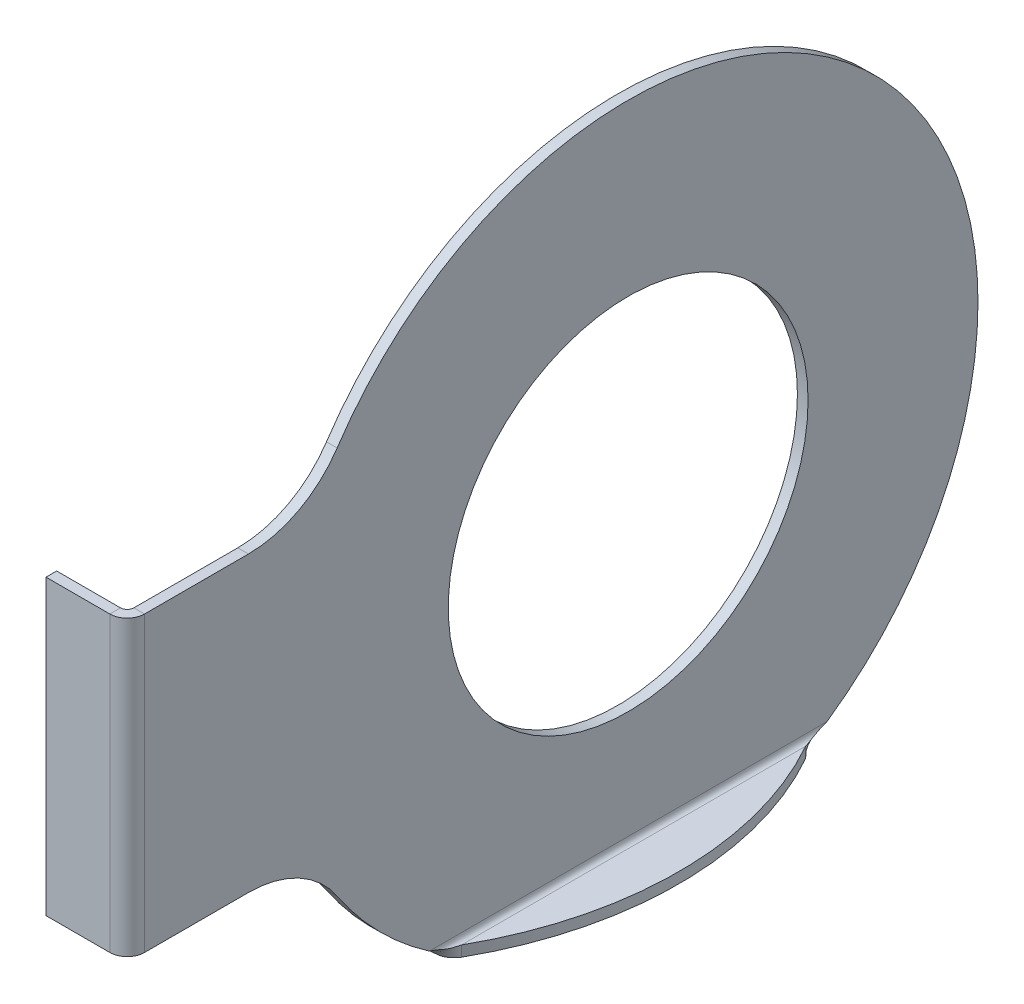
ISO-10303-21;
HEADER;
FILE_DESCRIPTION(('STEP AP214'),'2;1');
FILE_NAME('part.step','',(''),(''),'','','');
FILE_SCHEMA(('AUTOMOTIVE_DESIGN { 1 0 10303 214 1 1 1 1 }'));
ENDSEC;
DATA;
#1=APPLICATION_CONTEXT('core data for automotive mechanical design processes');
#2=APPLICATION_PROTOCOL_DEFINITION('international standard','automotive_design',2000,#1);
#3=PRODUCT_CONTEXT('',#1,'mechanical');
#4=PRODUCT('Part','Part','',(#3));
#5=PRODUCT_RELATED_PRODUCT_CATEGORY('part','',(#4));
#6=PRODUCT_DEFINITION_FORMATION('','',#4);
#7=PRODUCT_DEFINITION_CONTEXT('part definition',#1,'design');
#8=PRODUCT_DEFINITION('design','',#6,#7);
#9=PRODUCT_DEFINITION_SHAPE('','',#8);
#10=(LENGTH_UNIT() NAMED_UNIT(*) SI_UNIT(.MILLI.,.METRE.));
#11=(NAMED_UNIT(*) PLANE_ANGLE_UNIT() SI_UNIT($,.RADIAN.));
#12=(NAMED_UNIT(*) SI_UNIT($,.STERADIAN.) SOLID_ANGLE_UNIT());
#13=UNCERTAINTY_MEASURE_WITH_UNIT(LENGTH_MEASURE(1.E-05),#10,'distance_accuracy_value','');
#14=(GEOMETRIC_REPRESENTATION_CONTEXT(3) GLOBAL_UNCERTAINTY_ASSIGNED_CONTEXT((#13)) GLOBAL_UNIT_ASSIGNED_CONTEXT((#10,
#11,#12)) REPRESENTATION_CONTEXT('',''));
#15=CARTESIAN_POINT('',(0.,0.,0.));
#16=DIRECTION('',(0.,0.,1.));
#17=DIRECTION('',(1.,0.,0.));
#18=AXIS2_PLACEMENT_3D('',#15,#16,#17);
#19=CARTESIAN_POINT('',(0.,38.,56.9934206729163));
#20=DIRECTION('',(-1.,0.,0.));
#21=DIRECTION('',(0.,0.,1.));
#22=AXIS2_PLACEMENT_3D('',#19,#20,#21);
#23=PLANE('',#22);
#24=CARTESIAN_POINT('',(0.,0.,0.));
#25=DIRECTION('',(1.,0.,0.));
#26=DIRECTION('',(0.,0.,-1.));
#27=AXIS2_PLACEMENT_3D('',#24,#25,#26);
#28=CIRCLE('',#27,27.);
#29=CARTESIAN_POINT('',(0.,0.,-27.));
#30=VERTEX_POINT('',#29);
#31=EDGE_CURVE('E324',#30,#30,#28,.T.);
#32=ORIENTED_EDGE('',*,*,#31,.T.);
#33=EDGE_LOOP('',(#32));
#34=FACE_BOUND('',#33,.T.);
#35=DIRECTION('',(0.,0.,-1.));
#36=VECTOR('',#35,1.);
#37=CARTESIAN_POINT('',(0.,-22.,56.9934206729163));
#38=LINE('',#37,#36);
#39=CARTESIAN_POINT('',(0.,-22.,72.590498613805));
#40=VERTEX_POINT('',#39);
#41=CARTESIAN_POINT('',(0.,-22.,56.9934206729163));
#42=VERTEX_POINT('',#41);
#43=EDGE_CURVE('E74',#40,#42,#38,.T.);
#44=ORIENTED_EDGE('',*,*,#43,.F.);
#45=DIRECTION('',(0.,1.,0.));
#46=VECTOR('',#45,1.);
#47=CARTESIAN_POINT('',(0.,38.,72.590498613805));
#48=LINE('',#47,#46);
#49=CARTESIAN_POINT('',(0.,22.,72.590498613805));
#50=VERTEX_POINT('',#49);
#51=EDGE_CURVE('E66',#40,#50,#48,.T.);
#52=ORIENTED_EDGE('',*,*,#51,.T.);
#53=DIRECTION('',(0.,0.,1.));
#54=VECTOR('',#53,1.);
#55=CARTESIAN_POINT('',(0.,22.,56.9934206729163));
#56=LINE('',#55,#54);
#57=CARTESIAN_POINT('',(0.,22.,56.9934206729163));
#58=VERTEX_POINT('',#57);
#59=EDGE_CURVE('E82',#58,#50,#56,.T.);
#60=ORIENTED_EDGE('',*,*,#59,.F.);
#61=CARTESIAN_POINT('',(0.,38.,56.9934206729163));
#62=DIRECTION('',(-1.,0.,0.));
#63=DIRECTION('',(0.,0.,1.));
#64=AXIS2_PLACEMENT_3D('',#61,#62,#63);
#65=CIRCLE('',#64,16.);
#66=CARTESIAN_POINT('',(0.,29.1240875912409,43.6810888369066));
#67=VERTEX_POINT('',#66);
#68=EDGE_CURVE('E323',#67,#58,#65,.T.);
#69=ORIENTED_EDGE('',*,*,#68,.F.);
#70=CARTESIAN_POINT('',(0.,0.,0.));
#71=DIRECTION('',(1.,0.,0.));
#72=DIRECTION('',(0.,0.,-1.));
#73=AXIS2_PLACEMENT_3D('',#70,#71,#72);
#74=CIRCLE('',#73,52.5);
#75=CARTESIAN_POINT('',(0.,-43.1949484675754,-29.8403489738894));
#76=VERTEX_POINT('',#75);
#77=EDGE_CURVE('E339',#76,#67,#74,.T.);
#78=ORIENTED_EDGE('',*,*,#77,.F.);
#79=DIRECTION('',(0.,0.,1.));
#80=VECTOR('',#79,1.);
#81=CARTESIAN_POINT('',(0.,-43.1949484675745,56.9934206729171));
#82=LINE('',#81,#80);
#83=CARTESIAN_POINT('',(0.,-43.1949484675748,29.8403489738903));
#84=VERTEX_POINT('',#83);
#85=EDGE_CURVE('E394',#76,#84,#82,.T.);
#86=ORIENTED_EDGE('',*,*,#85,.T.);
#87=CARTESIAN_POINT('',(0.,-29.1240875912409,43.6810888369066));
#88=VERTEX_POINT('',#87);
#89=EDGE_CURVE('E331',#88,#84,#74,.T.);
#90=ORIENTED_EDGE('',*,*,#89,.F.);
#91=CARTESIAN_POINT('',(0.,-38.,56.9934206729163));
#92=DIRECTION('',(-1.,0.,0.));
#93=DIRECTION('',(0.,0.,-1.));
#94=AXIS2_PLACEMENT_3D('',#91,#92,#93);
#95=CIRCLE('',#94,16.);
#96=EDGE_CURVE('E337',#42,#88,#95,.T.);
#97=ORIENTED_EDGE('',*,*,#96,.F.);
#98=EDGE_LOOP('',(#44,#52,#60,#69,#78,#86,#90,#97));
#99=FACE_BOUND('',#98,.T.);
#100=ADVANCED_FACE('F57',(#34,#99),#23,.T.);
#101=CARTESIAN_POINT('',(1.6,0.,0.));
#102=DIRECTION('',(-1.,0.,0.));
#103=DIRECTION('',(0.,0.,1.));
#104=AXIS2_PLACEMENT_3D('',#101,#102,#103);
#105=CYLINDRICAL_SURFACE('',#104,52.5);
#106=CARTESIAN_POINT('',(1.6,-43.1949484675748,29.8403489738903));
#107=CARTESIAN_POINT('',(0.,-43.1949484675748,29.8403489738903));
#108=B_SPLINE_CURVE_WITH_KNOTS('',1,(#106,#107),.UNSPECIFIED.,.F.,.F.,(2,2),(0.,1.),.UNSPECIFIED.);
#109=CARTESIAN_POINT('',(1.6,-43.1949484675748,29.8403489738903));
#110=VERTEX_POINT('',#109);
#111=EDGE_CURVE('E311',#110,#84,#108,.T.);
#112=ORIENTED_EDGE('',*,*,#111,.F.);
#113=CARTESIAN_POINT('',(1.6,0.,0.));
#114=DIRECTION('',(1.,0.,0.));
#115=DIRECTION('',(0.,0.,-1.));
#116=AXIS2_PLACEMENT_3D('',#113,#114,#115);
#117=CIRCLE('',#116,52.5);
#118=CARTESIAN_POINT('',(1.6,-29.1240875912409,43.6810888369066));
#119=VERTEX_POINT('',#118);
#120=EDGE_CURVE('E344',#119,#110,#117,.T.);
#121=ORIENTED_EDGE('',*,*,#120,.F.);
#122=DIRECTION('',(-1.,0.,0.));
#123=VECTOR('',#122,1.);
#124=CARTESIAN_POINT('',(1.6,-29.1240875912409,43.6810888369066));
#125=LINE('',#124,#123);
#126=EDGE_CURVE('E343',#119,#88,#125,.T.);
#127=ORIENTED_EDGE('',*,*,#126,.T.);
#128=ORIENTED_EDGE('',*,*,#89,.T.);
#129=EDGE_LOOP('',(#112,#121,#127,#128));
#130=FACE_BOUND('',#129,.T.);
#131=ADVANCED_FACE('F382',(#130),#105,.T.);
#132=CARTESIAN_POINT('',(1.6,38.,56.9934206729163));
#133=DIRECTION('',(-1.,0.,0.));
#134=DIRECTION('',(0.,0.,1.));
#135=AXIS2_PLACEMENT_3D('',#132,#133,#134);
#136=PLANE('',#135);
#137=DIRECTION('',(0.,1.,0.));
#138=VECTOR('',#137,1.);
#139=CARTESIAN_POINT('',(1.6,38.,72.590498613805));
#140=LINE('',#139,#138);
#141=CARTESIAN_POINT('',(1.6,-22.,72.590498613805));
#142=VERTEX_POINT('',#141);
#143=CARTESIAN_POINT('',(1.6,22.,72.590498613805));
#144=VERTEX_POINT('',#143);
#145=EDGE_CURVE('E405',#142,#144,#140,.T.);
#146=ORIENTED_EDGE('',*,*,#145,.F.);
#147=DIRECTION('',(0.,0.,-1.));
#148=VECTOR('',#147,1.);
#149=CARTESIAN_POINT('',(1.6,-22.,56.9934206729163));
#150=LINE('',#149,#148);
#151=CARTESIAN_POINT('',(1.6,-22.,56.9934206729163));
#152=VERTEX_POINT('',#151);
#153=EDGE_CURVE('E61',#142,#152,#150,.T.);
#154=ORIENTED_EDGE('',*,*,#153,.T.);
#155=CARTESIAN_POINT('',(1.6,-38.,56.9934206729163));
#156=DIRECTION('',(-1.,0.,0.));
#157=DIRECTION('',(0.,0.,-1.));
#158=AXIS2_PLACEMENT_3D('',#155,#156,#157);
#159=CIRCLE('',#158,16.);
#160=EDGE_CURVE('E332',#152,#119,#159,.T.);
#161=ORIENTED_EDGE('',*,*,#160,.T.);
#162=ORIENTED_EDGE('',*,*,#120,.T.);
#163=DIRECTION('',(0.,0.,1.));
#164=VECTOR('',#163,1.);
#165=CARTESIAN_POINT('',(1.6,-43.1949484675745,56.9934206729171));
#166=LINE('',#165,#164);
#167=CARTESIAN_POINT('',(1.6,-43.1949484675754,-29.8403489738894));
#168=VERTEX_POINT('',#167);
#169=EDGE_CURVE('E352',#168,#110,#166,.T.);
#170=ORIENTED_EDGE('',*,*,#169,.F.);
#171=CARTESIAN_POINT('',(1.6,29.1240875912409,43.6810888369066));
#172=VERTEX_POINT('',#171);
#173=EDGE_CURVE('E334',#168,#172,#117,.T.);
#174=ORIENTED_EDGE('',*,*,#173,.T.);
#175=CARTESIAN_POINT('',(1.6,38.,56.9934206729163));
#176=DIRECTION('',(-1.,0.,0.));
#177=DIRECTION('',(0.,0.,1.));
#178=AXIS2_PLACEMENT_3D('',#175,#176,#177);
#179=CIRCLE('',#178,16.);
#180=CARTESIAN_POINT('',(1.6,22.,56.9934206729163));
#181=VERTEX_POINT('',#180);
#182=EDGE_CURVE('E327',#172,#181,#179,.T.);
#183=ORIENTED_EDGE('',*,*,#182,.T.);
#184=DIRECTION('',(0.,0.,1.));
#185=VECTOR('',#184,1.);
#186=CARTESIAN_POINT('',(1.6,22.,56.9934206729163));
#187=LINE('',#186,#185);
#188=EDGE_CURVE('E330',#181,#144,#187,.T.);
#189=ORIENTED_EDGE('',*,*,#188,.T.);
#190=EDGE_LOOP('',(#146,#154,#161,#162,#170,#174,#183,#189));
#191=FACE_BOUND('',#190,.T.);
#192=CARTESIAN_POINT('',(1.6,0.,0.));
#193=DIRECTION('',(1.,0.,0.));
#194=DIRECTION('',(0.,0.,-1.));
#195=AXIS2_PLACEMENT_3D('',#192,#193,#194);
#196=CIRCLE('',#195,27.);
#197=CARTESIAN_POINT('',(1.6,0.,-27.));
#198=VERTEX_POINT('',#197);
#199=EDGE_CURVE('E315',#198,#198,#196,.T.);
#200=ORIENTED_EDGE('',*,*,#199,.F.);
#201=EDGE_LOOP('',(#200));
#202=FACE_BOUND('',#201,.T.);
#203=ADVANCED_FACE('F384',(#191,#202),#136,.F.);
#204=CARTESIAN_POINT('',(1.6,38.,56.9934206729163));
#205=DIRECTION('',(-1.,0.,0.));
#206=DIRECTION('',(0.,0.,1.));
#207=AXIS2_PLACEMENT_3D('',#204,#205,#206);
#208=CYLINDRICAL_SURFACE('',#207,16.);
#209=ORIENTED_EDGE('',*,*,#68,.T.);
#210=DIRECTION('',(-1.,0.,0.));
#211=VECTOR('',#210,1.);
#212=CARTESIAN_POINT('',(1.6,22.,56.9934206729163));
#213=LINE('',#212,#211);
#214=EDGE_CURVE('E350',#181,#58,#213,.T.);
#215=ORIENTED_EDGE('',*,*,#214,.F.);
#216=ORIENTED_EDGE('',*,*,#182,.F.);
#217=DIRECTION('',(-1.,0.,0.));
#218=VECTOR('',#217,1.);
#219=CARTESIAN_POINT('',(1.6,29.1240875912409,43.6810888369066));
#220=LINE('',#219,#218);
#221=EDGE_CURVE('E340',#172,#67,#220,.T.);
#222=ORIENTED_EDGE('',*,*,#221,.T.);
#223=EDGE_LOOP('',(#209,#215,#216,#222));
#224=FACE_BOUND('',#223,.T.);
#225=ADVANCED_FACE('F383',(#224),#208,.F.);
#226=CARTESIAN_POINT('',(1.6,22.,56.9934206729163));
#227=DIRECTION('',(0.,-1.,0.));
#228=DIRECTION('',(0.,0.,-1.));
#229=AXIS2_PLACEMENT_3D('',#226,#227,#228);
#230=PLANE('',#229);
#231=DIRECTION('',(-1.,0.,0.));
#232=VECTOR('',#231,1.);
#233=CARTESIAN_POINT('',(1.6,22.,72.590498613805));
#234=LINE('',#233,#232);
#235=EDGE_CURVE('E425',#144,#50,#234,.T.);
#236=ORIENTED_EDGE('',*,*,#235,.F.);
#237=ORIENTED_EDGE('',*,*,#188,.F.);
#238=ORIENTED_EDGE('',*,*,#214,.T.);
#239=ORIENTED_EDGE('',*,*,#59,.T.);
#240=EDGE_LOOP('',(#236,#237,#238,#239));
#241=FACE_BOUND('',#240,.T.);
#242=ADVANCED_FACE('F536',(#241),#230,.F.);
#243=CARTESIAN_POINT('',(1.6,-22.,56.9934206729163));
#244=DIRECTION('',(0.,1.,0.));
#245=DIRECTION('',(0.,0.,1.));
#246=AXIS2_PLACEMENT_3D('',#243,#244,#245);
#247=PLANE('',#246);
#248=DIRECTION('',(1.,0.,0.));
#249=VECTOR('',#248,1.);
#250=CARTESIAN_POINT('',(1.6,-22.,72.590498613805));
#251=LINE('',#250,#249);
#252=EDGE_CURVE('E12',#40,#142,#251,.T.);
#253=ORIENTED_EDGE('',*,*,#252,.F.);
#254=ORIENTED_EDGE('',*,*,#43,.T.);
#255=DIRECTION('',(-1.,0.,0.));
#256=VECTOR('',#255,1.);
#257=CARTESIAN_POINT('',(1.6,-22.,56.9934206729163));
#258=LINE('',#257,#256);
#259=EDGE_CURVE('E347',#152,#42,#258,.T.);
#260=ORIENTED_EDGE('',*,*,#259,.F.);
#261=ORIENTED_EDGE('',*,*,#153,.F.);
#262=EDGE_LOOP('',(#253,#254,#260,#261));
#263=FACE_BOUND('',#262,.T.);
#264=ADVANCED_FACE('F59',(#263),#247,.F.);
#265=CARTESIAN_POINT('',(1.6,-38.,56.9934206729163));
#266=DIRECTION('',(-1.,0.,0.));
#267=DIRECTION('',(0.,0.,1.));
#268=AXIS2_PLACEMENT_3D('',#265,#266,#267);
#269=CYLINDRICAL_SURFACE('',#268,16.);
#270=ORIENTED_EDGE('',*,*,#96,.T.);
#271=ORIENTED_EDGE('',*,*,#126,.F.);
#272=ORIENTED_EDGE('',*,*,#160,.F.);
#273=ORIENTED_EDGE('',*,*,#259,.T.);
#274=EDGE_LOOP('',(#270,#271,#272,#273));
#275=FACE_BOUND('',#274,.T.);
#276=ADVANCED_FACE('F380',(#275),#269,.F.);
#277=CARTESIAN_POINT('',(0.,-43.1949484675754,-29.8403489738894));
#278=CARTESIAN_POINT('',(1.6,-43.1949484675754,-29.8403489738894));
#279=B_SPLINE_CURVE_WITH_KNOTS('',1,(#277,#278),.UNSPECIFIED.,.F.,.F.,(2,2),(0.,1.),.UNSPECIFIED.);
#280=EDGE_CURVE('E401',#76,#168,#279,.T.);
#281=ORIENTED_EDGE('',*,*,#280,.F.);
#282=ORIENTED_EDGE('',*,*,#77,.T.);
#283=ORIENTED_EDGE('',*,*,#221,.F.);
#284=ORIENTED_EDGE('',*,*,#173,.F.);
#285=EDGE_LOOP('',(#281,#282,#283,#284));
#286=FACE_BOUND('',#285,.T.);
#287=ADVANCED_FACE('F370',(#286),#105,.T.);
#288=CARTESIAN_POINT('',(1.6,0.,0.));
#289=DIRECTION('',(-1.,0.,0.));
#290=DIRECTION('',(0.,0.,1.));
#291=AXIS2_PLACEMENT_3D('',#288,#289,#290);
#292=CYLINDRICAL_SURFACE('',#291,27.);
#293=ORIENTED_EDGE('',*,*,#199,.T.);
#294=EDGE_LOOP('',(#293));
#295=FACE_BOUND('',#294,.T.);
#296=ORIENTED_EDGE('',*,*,#31,.F.);
#297=EDGE_LOOP('',(#296));
#298=FACE_BOUND('',#297,.T.);
#299=ADVANCED_FACE('F285',(#295,#298),#292,.F.);
#300=CARTESIAN_POINT('',(2.39999999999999,-45.5949484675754,-25.8265055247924));
#301=CARTESIAN_POINT('',(2.08581418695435,-45.5949484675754,-26.1610207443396));
#302=CARTESIAN_POINT('',(1.77180507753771,-45.5324828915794,-26.4954794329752));
#303=CARTESIAN_POINT('',(1.19131444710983,-45.2920357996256,-27.164453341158));
#304=CARTESIAN_POINT('',(0.925087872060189,-45.114148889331,-27.4989402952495));
#305=CARTESIAN_POINT('',(0.480799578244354,-44.6698605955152,-28.1679142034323));
#306=CARTESIAN_POINT('',(0.302912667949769,-44.4036340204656,-28.5024011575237));
#307=CARTESIAN_POINT('',(0.0624655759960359,-43.8231433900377,-29.1713750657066));
#308=CARTESIAN_POINT('',(0.,-43.5091342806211,-29.5058337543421));
#309=CARTESIAN_POINT('',(0.,-43.1949484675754,-29.8403489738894));
#310=CARTESIAN_POINT('',(2.4,-43.9949484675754,-25.8265055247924));
#311=CARTESIAN_POINT('',(2.2952785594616,-43.9949484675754,-26.1609978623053));
#312=CARTESIAN_POINT('',(2.19060169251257,-43.9741266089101,-26.4954794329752));
#313=CARTESIAN_POINT('',(1.99710481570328,-43.8939775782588,-27.1644533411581));
#314=CARTESIAN_POINT('',(1.90836262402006,-43.834681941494,-27.4989402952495));
#315=CARTESIAN_POINT('',(1.76026652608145,-43.6865858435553,-28.1679142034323));
#316=CARTESIAN_POINT('',(1.70097088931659,-43.5978436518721,-28.5024011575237));
#317=CARTESIAN_POINT('',(1.62082185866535,-43.4043467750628,-29.1713750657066));
#318=CARTESIAN_POINT('',(1.6,-43.2996699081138,-29.5058566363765));
#319=CARTESIAN_POINT('',(1.6,-43.1949484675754,-29.8403489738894));
#320=B_SPLINE_SURFACE_WITH_KNOTS('',1,3,((#300,#301,#302,#303,#304,#305,#306,#307,#308,#309),
(#310,#311,#312,#313,#314,#315,#316,#317,#318,#319)),.UNSPECIFIED.,.F.,.F.,.F.,(2,2),(4,2,2,2,
4),(0.,1.),(0.,0.25,0.5,0.75,1.),.UNSPECIFIED.);
#321=CARTESIAN_POINT('',(2.4,-43.9949484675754,-25.8265055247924));
#322=CARTESIAN_POINT('',(2.39999999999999,-45.5949484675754,-25.8265055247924));
#323=B_SPLINE_CURVE_WITH_KNOTS('',1,(#321,#322),.UNSPECIFIED.,.F.,.F.,(2,2),(0.,1.),.UNSPECIFIED.);
#324=CARTESIAN_POINT('',(2.40000000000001,-45.5949484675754,-25.8265055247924));
#325=VERTEX_POINT('',#324);
#326=CARTESIAN_POINT('',(2.4,-43.9949484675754,-25.8265055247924));
#327=VERTEX_POINT('',#326);
#328=EDGE_CURVE('E492',#325,#327,#323,.F.);
#329=CARTESIAN_POINT('',(2.39999999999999,-45.5949484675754,-25.8265055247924));
#330=CARTESIAN_POINT('',(2.08581418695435,-45.5949484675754,-26.1610207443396));
#331=CARTESIAN_POINT('',(1.77180507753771,-45.5324828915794,-26.4954794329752));
#332=CARTESIAN_POINT('',(1.19131444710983,-45.2920357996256,-27.164453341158));
#333=CARTESIAN_POINT('',(0.925087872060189,-45.114148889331,-27.4989402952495));
#334=CARTESIAN_POINT('',(0.480799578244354,-44.6698605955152,-28.1679142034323));
#335=CARTESIAN_POINT('',(0.302912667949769,-44.4036340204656,-28.5024011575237));
#336=CARTESIAN_POINT('',(0.0624655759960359,-43.8231433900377,-29.1713750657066));
#337=CARTESIAN_POINT('',(0.,-43.5091342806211,-29.5058337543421));
#338=CARTESIAN_POINT('',(0.,-43.1949484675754,-29.8403489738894));
#339=B_SPLINE_CURVE_WITH_KNOTS('',3,(#329,#330,#331,#332,#333,#334,#335,#336,#337,#338),
.UNSPECIFIED.,.F.,.F.,(4,2,2,2,4),(0.,0.25,0.5,0.75,1.),.UNSPECIFIED.);
#340=EDGE_CURVE('E496',#325,#76,#339,.T.);
#341=CARTESIAN_POINT('',(1.6,-43.1949484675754,-29.8403489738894));
#342=CARTESIAN_POINT('',(1.6,-43.2996699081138,-29.5058566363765));
#343=CARTESIAN_POINT('',(1.62082185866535,-43.4043467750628,-29.1713750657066));
#344=CARTESIAN_POINT('',(1.70097088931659,-43.5978436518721,-28.5024011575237));
#345=CARTESIAN_POINT('',(1.76026652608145,-43.6865858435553,-28.1679142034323));
#346=CARTESIAN_POINT('',(1.90836262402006,-43.834681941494,-27.4989402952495));
#347=CARTESIAN_POINT('',(1.99710481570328,-43.8939775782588,-27.1644533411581));
#348=CARTESIAN_POINT('',(2.19060169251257,-43.9741266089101,-26.4954794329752));
#349=CARTESIAN_POINT('',(2.2952785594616,-43.9949484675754,-26.1609978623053));
#350=CARTESIAN_POINT('',(2.4,-43.9949484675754,-25.8265055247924));
#351=B_SPLINE_CURVE_WITH_KNOTS('',3,(#341,#342,#343,#344,#345,#346,#347,#348,#349,#350),
.UNSPECIFIED.,.F.,.F.,(4,2,2,2,4),(0.,0.25,0.5,0.75,1.),.UNSPECIFIED.);
#352=EDGE_CURVE('E506',#327,#168,#351,.F.);
#353=ORIENTED_EDGE('',*,*,#328,.F.);
#354=ORIENTED_EDGE('',*,*,#340,.T.);
#355=ORIENTED_EDGE('',*,*,#280,.T.);
#356=ORIENTED_EDGE('',*,*,#352,.F.);
#357=EDGE_LOOP('',(#353,#354,#355,#356));
#358=FACE_BOUND('',#357,.T.);
#359=ADVANCED_FACE('F281',(#358),#320,.F.);
#360=CARTESIAN_POINT('',(0.,-43.1949484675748,29.8403489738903));
#361=CARTESIAN_POINT('',(0.,-43.5431796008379,29.4564046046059));
#362=CARTESIAN_POINT('',(0.076945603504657,-43.8911191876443,29.097279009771));
#363=CARTESIAN_POINT('',(0.297152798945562,-44.3647101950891,28.5956071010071));
#364=CARTESIAN_POINT('',(0.387796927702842,-44.514549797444,28.4345643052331));
#365=CARTESIAN_POINT('',(0.546428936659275,-44.7219885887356,28.2022718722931));
#366=CARTESIAN_POINT('',(0.603071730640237,-44.7882550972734,28.1263863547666));
#367=CARTESIAN_POINT('',(0.693182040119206,-44.8827478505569,28.014876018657));
#368=CARTESIAN_POINT('',(0.724075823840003,-44.9134281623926,27.9780922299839));
#369=CARTESIAN_POINT('',(0.771633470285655,-44.9581546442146,27.9234960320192));
#370=CARTESIAN_POINT('',(0.787688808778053,-44.9728478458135,27.9053938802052));
#371=CARTESIAN_POINT('',(0.812067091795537,-44.9945560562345,27.8783855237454));
#372=CARTESIAN_POINT('',(0.820242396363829,-45.0017368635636,27.869406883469));
#373=CARTESIAN_POINT('',(0.832578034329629,-45.0124241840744,27.8559751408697));
#374=CARTESIAN_POINT('',(0.83670202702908,-45.015972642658,27.8515039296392));
#375=CARTESIAN_POINT('',(0.844974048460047,-45.0230414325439,27.8425735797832));
#376=CARTESIAN_POINT('',(0.849935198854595,-45.0272470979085,27.8372440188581));
#377=CARTESIAN_POINT('',(1.06747909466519,-45.2106024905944,27.6043698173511));
#378=CARTESIAN_POINT('',(1.31354979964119,-45.3532113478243,27.3224610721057));
#379=CARTESIAN_POINT('',(1.83981127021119,-45.5454082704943,26.6534091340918));
#380=CARTESIAN_POINT('',(2.11986170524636,-45.5949484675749,26.2662804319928));
#381=CARTESIAN_POINT('',(2.39999999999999,-45.5949484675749,25.8265055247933));
#382=CARTESIAN_POINT('',(1.6,-43.1949484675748,29.8403489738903));
#383=CARTESIAN_POINT('',(1.6,-43.3110139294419,29.4564429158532));
#384=CARTESIAN_POINT('',(1.62564853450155,-43.4270053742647,29.097279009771));
#385=CARTESIAN_POINT('',(1.69905093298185,-43.5848690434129,28.5956071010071));
#386=CARTESIAN_POINT('',(1.72926564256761,-43.6348155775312,28.4345643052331));
#387=CARTESIAN_POINT('',(1.78214297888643,-43.7039618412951,28.2022718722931));
#388=CARTESIAN_POINT('',(1.80102391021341,-43.7260506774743,28.1263863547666));
#389=CARTESIAN_POINT('',(1.83106068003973,-43.7575482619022,28.014876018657));
#390=CARTESIAN_POINT('',(1.84135860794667,-43.7677750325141,27.9780922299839));
#391=CARTESIAN_POINT('',(1.85721115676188,-43.7826838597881,27.9234960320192));
#392=CARTESIAN_POINT('',(1.86256293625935,-43.7875815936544,27.9053938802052));
#393=CARTESIAN_POINT('',(1.87068903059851,-43.7948176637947,27.8783855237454));
#394=CARTESIAN_POINT('',(1.87341413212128,-43.7972112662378,27.869406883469));
#395=CARTESIAN_POINT('',(1.87752601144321,-43.800773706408,27.8559751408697));
#396=CARTESIAN_POINT('',(1.87890067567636,-43.8019565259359,27.8515039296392));
#397=CARTESIAN_POINT('',(1.88165801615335,-43.8043127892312,27.8425735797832));
#398=CARTESIAN_POINT('',(1.88331173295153,-43.8057146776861,27.8372440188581));
#399=CARTESIAN_POINT('',(1.9558263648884,-43.8668331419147,27.6043698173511));
#400=CARTESIAN_POINT('',(2.03784993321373,-43.914369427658,27.3224610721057));
#401=CARTESIAN_POINT('',(2.21327042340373,-43.978435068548,26.6534091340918));
#402=CARTESIAN_POINT('',(2.30662318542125,-43.9949484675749,26.2662681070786));
#403=CARTESIAN_POINT('',(2.4,-43.9949484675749,25.8265055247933));
#404=B_SPLINE_SURFACE_WITH_KNOTS('',1,3,((#360,#361,#362,#363,#364,#365,#366,#367,#368,#369,
#370,#371,#372,#373,#374,#375,#376,#377,#378,#379,#380,#381),(#382,#383,#384,#385,#386,#387,
#388,#389,#390,#391,#392,#393,#394,#395,#396,#397,#398,#399,#400,#401,#402,#403)),.UNSPECIFIED.,
.F.,.F.,.F.,(2,2),(4,2,2,2,2,2,2,2,2,2,4),(0.,1.),(0.,0.25,0.375,0.4375,0.46875,0.484375,
0.4921875,0.49609375,0.5,0.75,1.),.UNSPECIFIED.);
#405=CARTESIAN_POINT('',(0.,-43.1949484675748,29.8403489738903));
#406=CARTESIAN_POINT('',(0.,-43.5431796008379,29.4564046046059));
#407=CARTESIAN_POINT('',(0.076945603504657,-43.8911191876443,29.097279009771));
#408=CARTESIAN_POINT('',(0.297152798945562,-44.3647101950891,28.5956071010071));
#409=CARTESIAN_POINT('',(0.387796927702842,-44.514549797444,28.4345643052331));
#410=CARTESIAN_POINT('',(0.546428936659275,-44.7219885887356,28.2022718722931));
#411=CARTESIAN_POINT('',(0.603071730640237,-44.7882550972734,28.1263863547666));
#412=CARTESIAN_POINT('',(0.693182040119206,-44.8827478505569,28.014876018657));
#413=CARTESIAN_POINT('',(0.724075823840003,-44.9134281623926,27.9780922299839));
#414=CARTESIAN_POINT('',(0.771633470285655,-44.9581546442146,27.9234960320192));
#415=CARTESIAN_POINT('',(0.787688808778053,-44.9728478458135,27.9053938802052));
#416=CARTESIAN_POINT('',(0.812067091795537,-44.9945560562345,27.8783855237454));
#417=CARTESIAN_POINT('',(0.820242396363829,-45.0017368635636,27.869406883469));
#418=CARTESIAN_POINT('',(0.832578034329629,-45.0124241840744,27.8559751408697));
#419=CARTESIAN_POINT('',(0.83670202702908,-45.015972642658,27.8515039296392));
#420=CARTESIAN_POINT('',(0.844974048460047,-45.0230414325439,27.8425735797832));
#421=CARTESIAN_POINT('',(0.849935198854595,-45.0272470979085,27.8372440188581));
#422=CARTESIAN_POINT('',(1.06747909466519,-45.2106024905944,27.6043698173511));
#423=CARTESIAN_POINT('',(1.31354979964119,-45.3532113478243,27.3224610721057));
#424=CARTESIAN_POINT('',(1.83981127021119,-45.5454082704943,26.6534091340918));
#425=CARTESIAN_POINT('',(2.11986170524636,-45.5949484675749,26.2662804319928));
#426=CARTESIAN_POINT('',(2.39999999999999,-45.5949484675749,25.8265055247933));
#427=B_SPLINE_CURVE_WITH_KNOTS('',3,(#405,#406,#407,#408,#409,#410,#411,#412,#413,#414,#415,
#416,#417,#418,#419,#420,#421,#422,#423,#424,#425,#426),.UNSPECIFIED.,.F.,.F.,(4,2,2,2,2,2,2,2,
2,2,4),(0.,0.25,0.375,0.4375,0.46875,0.484375,0.4921875,0.49609375,0.5,0.75,1.),.UNSPECIFIED.);
#428=CARTESIAN_POINT('',(2.40000000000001,-45.5949484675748,25.8265055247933));
#429=VERTEX_POINT('',#428);
#430=EDGE_CURVE('E253',#84,#429,#427,.T.);
#431=CARTESIAN_POINT('',(2.39999999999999,-45.5949484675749,25.8265055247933));
#432=CARTESIAN_POINT('',(2.4,-43.9949484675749,25.8265055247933));
#433=B_SPLINE_CURVE_WITH_KNOTS('',1,(#431,#432),.UNSPECIFIED.,.F.,.F.,(2,2),(0.,1.),.UNSPECIFIED.);
#434=CARTESIAN_POINT('',(2.40000000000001,-43.9949484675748,25.8265055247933));
#435=VERTEX_POINT('',#434);
#436=EDGE_CURVE('E493',#435,#429,#433,.F.);
#437=CARTESIAN_POINT('',(2.4,-43.9949484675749,25.8265055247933));
#438=CARTESIAN_POINT('',(2.30662318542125,-43.9949484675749,26.2662681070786));
#439=CARTESIAN_POINT('',(2.21327042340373,-43.978435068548,26.6534091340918));
#440=CARTESIAN_POINT('',(2.03784993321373,-43.914369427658,27.3224610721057));
#441=CARTESIAN_POINT('',(1.9558263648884,-43.8668331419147,27.6043698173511));
#442=CARTESIAN_POINT('',(1.88331173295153,-43.8057146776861,27.8372440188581));
#443=CARTESIAN_POINT('',(1.88165801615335,-43.8043127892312,27.8425735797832));
#444=CARTESIAN_POINT('',(1.87890067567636,-43.8019565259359,27.8515039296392));
#445=CARTESIAN_POINT('',(1.87752601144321,-43.800773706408,27.8559751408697));
#446=CARTESIAN_POINT('',(1.87341413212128,-43.7972112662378,27.869406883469));
#447=CARTESIAN_POINT('',(1.87068903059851,-43.7948176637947,27.8783855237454));
#448=CARTESIAN_POINT('',(1.86256293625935,-43.7875815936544,27.9053938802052));
#449=CARTESIAN_POINT('',(1.85721115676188,-43.7826838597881,27.9234960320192));
#450=CARTESIAN_POINT('',(1.84135860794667,-43.7677750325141,27.9780922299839));
#451=CARTESIAN_POINT('',(1.83106068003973,-43.7575482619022,28.014876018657));
#452=CARTESIAN_POINT('',(1.80102391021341,-43.7260506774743,28.1263863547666));
#453=CARTESIAN_POINT('',(1.78214297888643,-43.7039618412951,28.2022718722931));
#454=CARTESIAN_POINT('',(1.72926564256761,-43.6348155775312,28.4345643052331));
#455=CARTESIAN_POINT('',(1.69905093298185,-43.5848690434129,28.5956071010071));
#456=CARTESIAN_POINT('',(1.62564853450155,-43.4270053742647,29.097279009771));
#457=CARTESIAN_POINT('',(1.6,-43.3110139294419,29.4564429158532));
#458=CARTESIAN_POINT('',(1.6,-43.1949484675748,29.8403489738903));
#459=B_SPLINE_CURVE_WITH_KNOTS('',3,(#437,#438,#439,#440,#441,#442,#443,#444,#445,#446,#447,
#448,#449,#450,#451,#452,#453,#454,#455,#456,#457,#458),.UNSPECIFIED.,.F.,.F.,(4,2,2,2,2,2,2,2,
2,2,4),(0.,0.25,0.5,0.50390625,0.5078125,0.515625,0.53125,0.5625,0.625,0.75,1.),.UNSPECIFIED.);
#460=EDGE_CURVE('E246',#110,#435,#459,.F.);
#461=ORIENTED_EDGE('',*,*,#430,.T.);
#462=ORIENTED_EDGE('',*,*,#436,.F.);
#463=ORIENTED_EDGE('',*,*,#460,.F.);
#464=ORIENTED_EDGE('',*,*,#111,.T.);
#465=EDGE_LOOP('',(#461,#462,#463,#464));
#466=FACE_BOUND('',#465,.T.);
#467=ADVANCED_FACE('F221',(#466),#404,.F.);
#468=CARTESIAN_POINT('',(2.4,-43.1949484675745,59.7550186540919));
#469=DIRECTION('',(0.,0.,-1.));
#470=DIRECTION('',(0.,1.,0.));
#471=AXIS2_PLACEMENT_3D('',#468,#469,#470);
#472=CYLINDRICAL_SURFACE('',#471,0.8);
#473=ORIENTED_EDGE('',*,*,#169,.T.);
#474=ORIENTED_EDGE('',*,*,#460,.T.);
#475=DIRECTION('',(0.,0.,1.));
#476=VECTOR('',#475,1.);
#477=CARTESIAN_POINT('',(2.40000000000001,-43.9949484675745,56.9934206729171));
#478=LINE('',#477,#476);
#479=EDGE_CURVE('E497',#327,#435,#478,.T.);
#480=ORIENTED_EDGE('',*,*,#479,.F.);
#481=ORIENTED_EDGE('',*,*,#352,.T.);
#482=EDGE_LOOP('',(#473,#474,#480,#481));
#483=FACE_BOUND('',#482,.T.);
#484=ADVANCED_FACE('F210',(#483),#472,.F.);
#485=CARTESIAN_POINT('',(2.4,-43.1949484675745,59.7550186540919));
#486=DIRECTION('',(0.,0.,-1.));
#487=DIRECTION('',(0.,1.,0.));
#488=AXIS2_PLACEMENT_3D('',#485,#486,#487);
#489=CYLINDRICAL_SURFACE('',#488,2.4);
#490=ORIENTED_EDGE('',*,*,#85,.F.);
#491=ORIENTED_EDGE('',*,*,#340,.F.);
#492=DIRECTION('',(0.,0.,1.));
#493=VECTOR('',#492,1.);
#494=CARTESIAN_POINT('',(2.40000000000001,-45.5949484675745,56.9934206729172));
#495=LINE('',#494,#493);
#496=EDGE_CURVE('E197',#325,#429,#495,.T.);
#497=ORIENTED_EDGE('',*,*,#496,.T.);
#498=ORIENTED_EDGE('',*,*,#430,.F.);
#499=EDGE_LOOP('',(#490,#491,#497,#498));
#500=FACE_BOUND('',#499,.T.);
#501=ADVANCED_FACE('F220',(#500),#489,.T.);
#502=CARTESIAN_POINT('',(-81.3082225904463,-43.9949484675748,56.9934206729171));
#503=DIRECTION('',(0.,-1.,0.));
#504=DIRECTION('',(0.,0.,1.));
#505=AXIS2_PLACEMENT_3D('',#502,#503,#504);
#506=PLANE('',#505);
#507=CARTESIAN_POINT('',(-43.3082225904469,-43.9949484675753,4.58571788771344E-13));
#508=DIRECTION('',(0.,1.,0.));
#509=DIRECTION('',(0.,0.,-1.));
#510=AXIS2_PLACEMENT_3D('',#507,#508,#509);
#511=CIRCLE('',#510,52.5);
#512=EDGE_CURVE('E488',#435,#327,#511,.T.);
#513=ORIENTED_EDGE('',*,*,#512,.T.);
#514=ORIENTED_EDGE('',*,*,#479,.T.);
#515=EDGE_LOOP('',(#513,#514));
#516=FACE_BOUND('',#515,.T.);
#517=ADVANCED_FACE('F471',(#516),#506,.F.);
#518=CARTESIAN_POINT('',(-43.3082225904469,-43.9949484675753,4.58571788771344E-13));
#519=DIRECTION('',(0.,-1.,0.));
#520=DIRECTION('',(0.,0.,1.));
#521=AXIS2_PLACEMENT_3D('',#518,#519,#520);
#522=CYLINDRICAL_SURFACE('',#521,52.5);
#523=ORIENTED_EDGE('',*,*,#512,.F.);
#524=ORIENTED_EDGE('',*,*,#436,.T.);
#525=CARTESIAN_POINT('',(-43.3082225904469,-45.5949484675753,4.75314232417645E-13));
#526=DIRECTION('',(0.,1.,0.));
#527=DIRECTION('',(0.,0.,-1.));
#528=AXIS2_PLACEMENT_3D('',#525,#526,#527);
#529=CIRCLE('',#528,52.5);
#530=EDGE_CURVE('E491',#429,#325,#529,.T.);
#531=ORIENTED_EDGE('',*,*,#530,.T.);
#532=ORIENTED_EDGE('',*,*,#328,.T.);
#533=EDGE_LOOP('',(#523,#524,#531,#532));
#534=FACE_BOUND('',#533,.T.);
#535=ADVANCED_FACE('F462',(#534),#522,.T.);
#536=CARTESIAN_POINT('',(-81.3082225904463,-45.5949484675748,56.9934206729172));
#537=DIRECTION('',(0.,-1.,0.));
#538=DIRECTION('',(0.,0.,1.));
#539=AXIS2_PLACEMENT_3D('',#536,#537,#538);
#540=PLANE('',#539);
#541=ORIENTED_EDGE('',*,*,#496,.F.);
#542=ORIENTED_EDGE('',*,*,#530,.F.);
#543=EDGE_LOOP('',(#541,#542));
#544=FACE_BOUND('',#543,.T.);
#545=ADVANCED_FACE('F223',(#544),#540,.T.);
#546=CARTESIAN_POINT('',(-1.,-22.,72.590498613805));
#547=DIRECTION('',(0.,-1.,0.));
#548=DIRECTION('',(0.,0.,-1.));
#549=AXIS2_PLACEMENT_3D('',#546,#547,#548);
#550=PLANE('',#549);
#551=DIRECTION('',(0.,0.,1.));
#552=VECTOR('',#551,1.);
#553=CARTESIAN_POINT('',(-1.00000000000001,-22.,75.190498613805));
#554=LINE('',#553,#552);
#555=CARTESIAN_POINT('',(-1.00000000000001,-22.,73.590498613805));
#556=VERTEX_POINT('',#555);
#557=CARTESIAN_POINT('',(-1.00000000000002,-22.,75.190498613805));
#558=VERTEX_POINT('',#557);
#559=EDGE_CURVE('E444',#556,#558,#554,.T.);
#560=ORIENTED_EDGE('',*,*,#559,.F.);
#561=CARTESIAN_POINT('',(-1.,-22.,72.590498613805));
#562=DIRECTION('',(0.,-1.,0.));
#563=DIRECTION('',(0.,0.,-1.));
#564=AXIS2_PLACEMENT_3D('',#561,#562,#563);
#565=CIRCLE('',#564,1.);
#566=EDGE_CURVE('E198',#556,#40,#565,.F.);
#567=ORIENTED_EDGE('',*,*,#566,.T.);
#568=ORIENTED_EDGE('',*,*,#252,.T.);
#569=CARTESIAN_POINT('',(-1.,-22.,72.590498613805));
#570=DIRECTION('',(0.,1.,0.));
#571=DIRECTION('',(0.,0.,1.));
#572=AXIS2_PLACEMENT_3D('',#569,#570,#571);
#573=CIRCLE('',#572,2.6);
#574=EDGE_CURVE('E190',#558,#142,#573,.T.);
#575=ORIENTED_EDGE('',*,*,#574,.F.);
#576=EDGE_LOOP('',(#560,#567,#568,#575));
#577=FACE_BOUND('',#576,.T.);
#578=ADVANCED_FACE('F430',(#577),#550,.T.);
#579=CARTESIAN_POINT('',(-1.,22.,72.590498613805));
#580=DIRECTION('',(0.,1.,0.));
#581=DIRECTION('',(0.,0.,1.));
#582=AXIS2_PLACEMENT_3D('',#579,#580,#581);
#583=PLANE('',#582);
#584=CARTESIAN_POINT('',(-1.,22.,72.590498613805));
#585=DIRECTION('',(0.,-1.,0.));
#586=DIRECTION('',(0.,0.,-1.));
#587=AXIS2_PLACEMENT_3D('',#584,#585,#586);
#588=CIRCLE('',#587,1.);
#589=CARTESIAN_POINT('',(-1.00000000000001,22.,73.590498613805));
#590=VERTEX_POINT('',#589);
#591=EDGE_CURVE('E194',#50,#590,#588,.T.);
#592=ORIENTED_EDGE('',*,*,#591,.T.);
#593=DIRECTION('',(0.,0.,-1.));
#594=VECTOR('',#593,1.);
#595=CARTESIAN_POINT('',(-1.00000000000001,22.,75.190498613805));
#596=LINE('',#595,#594);
#597=CARTESIAN_POINT('',(-1.00000000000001,22.,75.190498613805));
#598=VERTEX_POINT('',#597);
#599=EDGE_CURVE('E168',#598,#590,#596,.T.);
#600=ORIENTED_EDGE('',*,*,#599,.F.);
#601=CARTESIAN_POINT('',(-1.,22.,72.590498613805));
#602=DIRECTION('',(0.,-1.,0.));
#603=DIRECTION('',(0.,0.,-1.));
#604=AXIS2_PLACEMENT_3D('',#601,#602,#603);
#605=CIRCLE('',#604,2.6);
#606=EDGE_CURVE('E193',#144,#598,#605,.T.);
#607=ORIENTED_EDGE('',*,*,#606,.F.);
#608=ORIENTED_EDGE('',*,*,#235,.T.);
#609=EDGE_LOOP('',(#592,#600,#607,#608));
#610=FACE_BOUND('',#609,.T.);
#611=ADVANCED_FACE('F451',(#610),#583,.T.);
#612=CARTESIAN_POINT('',(-1.,44.1197731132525,72.590498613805));
#613=DIRECTION('',(0.,-1.,0.));
#614=DIRECTION('',(0.,0.,-1.));
#615=AXIS2_PLACEMENT_3D('',#612,#613,#614);
#616=CYLINDRICAL_SURFACE('',#615,2.6);
#617=ORIENTED_EDGE('',*,*,#145,.T.);
#618=ORIENTED_EDGE('',*,*,#606,.T.);
#619=DIRECTION('',(0.,1.,0.));
#620=VECTOR('',#619,1.);
#621=CARTESIAN_POINT('',(-1.00000000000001,38.,75.190498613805));
#622=LINE('',#621,#620);
#623=EDGE_CURVE('E434',#558,#598,#622,.T.);
#624=ORIENTED_EDGE('',*,*,#623,.F.);
#625=ORIENTED_EDGE('',*,*,#574,.T.);
#626=EDGE_LOOP('',(#617,#618,#624,#625));
#627=FACE_BOUND('',#626,.T.);
#628=ADVANCED_FACE('F433',(#627),#616,.T.);
#629=CARTESIAN_POINT('',(-1.,44.1197731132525,72.590498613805));
#630=DIRECTION('',(0.,-1.,0.));
#631=DIRECTION('',(0.,0.,-1.));
#632=AXIS2_PLACEMENT_3D('',#629,#630,#631);
#633=CYLINDRICAL_SURFACE('',#632,1.);
#634=ORIENTED_EDGE('',*,*,#51,.F.);
#635=ORIENTED_EDGE('',*,*,#566,.F.);
#636=DIRECTION('',(0.,1.,0.));
#637=VECTOR('',#636,1.);
#638=CARTESIAN_POINT('',(-1.00000000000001,38.,73.590498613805));
#639=LINE('',#638,#637);
#640=EDGE_CURVE('E185',#556,#590,#639,.T.);
#641=ORIENTED_EDGE('',*,*,#640,.T.);
#642=ORIENTED_EDGE('',*,*,#591,.F.);
#643=EDGE_LOOP('',(#634,#635,#641,#642));
#644=FACE_BOUND('',#643,.T.);
#645=ADVANCED_FACE('F455',(#644),#633,.F.);
#646=CARTESIAN_POINT('',(-10.5820679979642,-22.,75.1904986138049));
#647=DIRECTION('',(1.,0.,0.));
#648=DIRECTION('',(0.,0.,-1.));
#649=AXIS2_PLACEMENT_3D('',#646,#647,#648);
#650=PLANE('',#649);
#651=DIRECTION('',(0.,-1.,0.));
#652=VECTOR('',#651,1.);
#653=CARTESIAN_POINT('',(-10.5820679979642,-22.,73.5904986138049));
#654=LINE('',#653,#652);
#655=CARTESIAN_POINT('',(-10.5820679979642,22.,73.5904986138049));
#656=VERTEX_POINT('',#655);
#657=CARTESIAN_POINT('',(-10.5820679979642,-22.,73.5904986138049));
#658=VERTEX_POINT('',#657);
#659=EDGE_CURVE('E178',#656,#658,#654,.T.);
#660=ORIENTED_EDGE('',*,*,#659,.T.);
#661=DIRECTION('',(0.,0.,-1.));
#662=VECTOR('',#661,1.);
#663=CARTESIAN_POINT('',(-10.5820679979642,-22.,75.1904986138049));
#664=LINE('',#663,#662);
#665=CARTESIAN_POINT('',(-10.5820679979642,-22.,75.1904986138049));
#666=VERTEX_POINT('',#665);
#667=EDGE_CURVE('E201',#666,#658,#664,.T.);
#668=ORIENTED_EDGE('',*,*,#667,.F.);
#669=DIRECTION('',(0.,-1.,0.));
#670=VECTOR('',#669,1.);
#671=CARTESIAN_POINT('',(-10.5820679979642,-22.,75.1904986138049));
#672=LINE('',#671,#670);
#673=CARTESIAN_POINT('',(-10.5820679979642,22.,75.1904986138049));
#674=VERTEX_POINT('',#673);
#675=EDGE_CURVE('E180',#674,#666,#672,.T.);
#676=ORIENTED_EDGE('',*,*,#675,.F.);
#677=DIRECTION('',(0.,0.,-1.));
#678=VECTOR('',#677,1.);
#679=CARTESIAN_POINT('',(-10.5820679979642,22.,75.1904986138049));
#680=LINE('',#679,#678);
#681=EDGE_CURVE('E165',#674,#656,#680,.T.);
#682=ORIENTED_EDGE('',*,*,#681,.T.);
#683=EDGE_LOOP('',(#660,#668,#676,#682));
#684=FACE_BOUND('',#683,.T.);
#685=ADVANCED_FACE('F176',(#684),#650,.F.);
#686=CARTESIAN_POINT('',(17.4245113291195,38.,75.190498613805));
#687=DIRECTION('',(0.,0.,-1.));
#688=DIRECTION('',(-1.,0.,0.));
#689=AXIS2_PLACEMENT_3D('',#686,#687,#688);
#690=PLANE('',#689);
#691=DIRECTION('',(1.,0.,0.));
#692=VECTOR('',#691,1.);
#693=CARTESIAN_POINT('',(17.4245113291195,-22.,75.190498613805));
#694=LINE('',#693,#692);
#695=EDGE_CURVE('E181',#666,#558,#694,.T.);
#696=ORIENTED_EDGE('',*,*,#695,.T.);
#697=ORIENTED_EDGE('',*,*,#623,.T.);
#698=DIRECTION('',(-1.,0.,0.));
#699=VECTOR('',#698,1.);
#700=CARTESIAN_POINT('',(17.4245113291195,22.,75.190498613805));
#701=LINE('',#700,#699);
#702=EDGE_CURVE('E437',#598,#674,#701,.T.);
#703=ORIENTED_EDGE('',*,*,#702,.T.);
#704=ORIENTED_EDGE('',*,*,#675,.T.);
#705=EDGE_LOOP('',(#696,#697,#703,#704));
#706=FACE_BOUND('',#705,.T.);
#707=ADVANCED_FACE('F449',(#706),#690,.F.);
#708=CARTESIAN_POINT('',(17.4245113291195,22.,75.190498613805));
#709=DIRECTION('',(0.,-1.,0.));
#710=DIRECTION('',(1.,0.,0.));
#711=AXIS2_PLACEMENT_3D('',#708,#709,#710);
#712=PLANE('',#711);
#713=ORIENTED_EDGE('',*,*,#702,.F.);
#714=ORIENTED_EDGE('',*,*,#599,.T.);
#715=DIRECTION('',(-1.,0.,0.));
#716=VECTOR('',#715,1.);
#717=CARTESIAN_POINT('',(17.4245113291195,22.,73.590498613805));
#718=LINE('',#717,#716);
#719=EDGE_CURVE('E161',#590,#656,#718,.T.);
#720=ORIENTED_EDGE('',*,*,#719,.T.);
#721=ORIENTED_EDGE('',*,*,#681,.F.);
#722=EDGE_LOOP('',(#713,#714,#720,#721));
#723=FACE_BOUND('',#722,.T.);
#724=ADVANCED_FACE('F164',(#723),#712,.F.);
#725=CARTESIAN_POINT('',(17.4245113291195,38.,73.590498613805));
#726=DIRECTION('',(0.,0.,-1.));
#727=DIRECTION('',(-1.,0.,0.));
#728=AXIS2_PLACEMENT_3D('',#725,#726,#727);
#729=PLANE('',#728);
#730=ORIENTED_EDGE('',*,*,#640,.F.);
#731=DIRECTION('',(1.,0.,0.));
#732=VECTOR('',#731,1.);
#733=CARTESIAN_POINT('',(17.4245113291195,-22.,73.590498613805));
#734=LINE('',#733,#732);
#735=EDGE_CURVE('E173',#658,#556,#734,.T.);
#736=ORIENTED_EDGE('',*,*,#735,.F.);
#737=ORIENTED_EDGE('',*,*,#659,.F.);
#738=ORIENTED_EDGE('',*,*,#719,.F.);
#739=EDGE_LOOP('',(#730,#736,#737,#738));
#740=FACE_BOUND('',#739,.T.);
#741=ADVANCED_FACE('F184',(#740),#729,.T.);
#742=CARTESIAN_POINT('',(17.4245113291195,-22.,75.190498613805));
#743=DIRECTION('',(0.,1.,0.));
#744=DIRECTION('',(-1.,0.,0.));
#745=AXIS2_PLACEMENT_3D('',#742,#743,#744);
#746=PLANE('',#745);
#747=ORIENTED_EDGE('',*,*,#735,.T.);
#748=ORIENTED_EDGE('',*,*,#559,.T.);
#749=ORIENTED_EDGE('',*,*,#695,.F.);
#750=ORIENTED_EDGE('',*,*,#667,.T.);
#751=EDGE_LOOP('',(#747,#748,#749,#750));
#752=FACE_BOUND('',#751,.T.);
#753=ADVANCED_FACE('F448',(#752),#746,.F.);
#754=CLOSED_SHELL('',(#100,#131,#203,#225,#242,#264,#276,#287,#299,#359,#467,#484,#501,#517,
#535,#545,#578,#611,#628,#645,#685,#707,#724,#741,#753));
#755=MANIFOLD_SOLID_BREP('B2',#754);
#756=ADVANCED_BREP_SHAPE_REPRESENTATION('',(#18,#755),#14);
#757=SHAPE_DEFINITION_REPRESENTATION(#9,#756);
ENDSEC;
END-ISO-10303-21;
